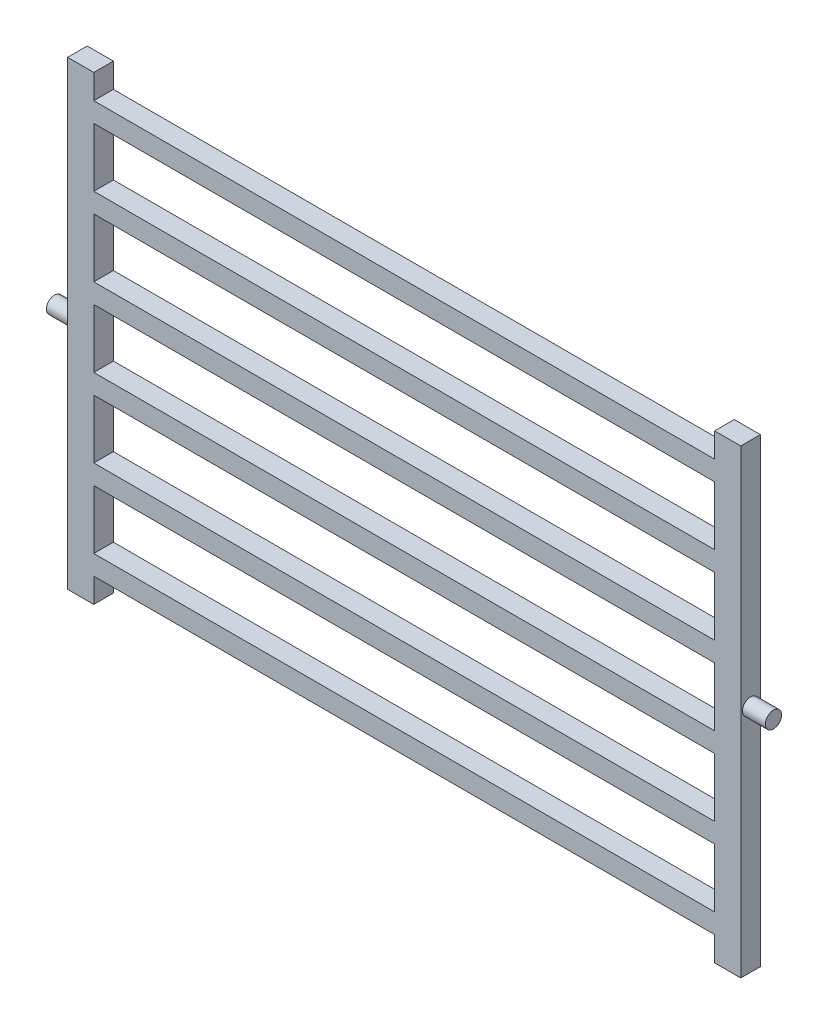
from build123d import *

# Parameters (mm, degrees)
BOSS_EXTRUDE3_START   = 2
SKETCH2_W             = 8
SKETCH2_H             = 141
BOSS_EXTRUDE3_DEPTH   = 6
BOSS_EXTRUDE3_2_DEPTH = 6
BOSS_EXTRUDE4_START   = 2
SKETCH3_W             = 190
SKETCH3_H             = 6
BOSS_EXTRUDE4_DEPTH   = 6
SKETCH8_R             = 2.5
BOSS_EXTRUDE7_DEPTH   = 7
BOSS_EXTRUDE8_START   = 7
SKETCH9_R             = 2.5
BOSS_EXTRUDE8_DEPTH   = 7


with BuildPart() as part:
    # Sketch2 → Boss-Extrude3 (new body)
    with BuildSketch(Plane.XY.offset(BOSS_EXTRUDE3_START)):
        with Locations((11, 87.5)):
            Rectangle(SKETCH2_W, SKETCH2_H)
    extrude(amount=BOSS_EXTRUDE3_DEPTH)



with BuildPart() as body_2:
    # Sketch2 → Boss-Extrude3 2 (new body)
    with BuildSketch(Plane.XY.offset(BOSS_EXTRUDE3_START)):
        with Locations((209, 87.5)):
            Rectangle(SKETCH2_W, SKETCH2_H)
    extrude(amount=BOSS_EXTRUDE3_2_DEPTH)


with BuildPart() as part_1:
    add(part.part)

    add(body_2.part)  # Boss-Extrude4 merges body 2
    # Sketch3 → Boss-Extrude4 (add)
    with BuildSketch(Plane.XY.offset(BOSS_EXTRUDE4_START)):
        with Locations((110, 51.5)):
            Rectangle(SKETCH3_W, SKETCH3_H)
        with Locations((110, 27.5)):
            Rectangle(SKETCH3_W, SKETCH3_H)
        with Locations((110, 75.5)):
            Rectangle(SKETCH3_W, SKETCH3_H)
        with Locations((110, 99.5)):
            Rectangle(SKETCH3_W, SKETCH3_H)
        with Locations((110, 123.5)):
            Rectangle(SKETCH3_W, SKETCH3_H)
        with Locations((110, 147.5)):
            Rectangle(SKETCH3_W, SKETCH3_H)
    extrude(amount=BOSS_EXTRUDE4_DEPTH)

    # Sketch8 → Boss-Extrude7 (add)
    with BuildSketch(Plane.ZY.offset(-7)):
        with Locations((5, 87.5)):
            Circle(SKETCH8_R)
    extrude(amount=BOSS_EXTRUDE7_DEPTH)

    # Sketch9 → Boss-Extrude8 (add)
    with BuildSketch(Plane(origin=(213, 0, 0), x_dir=(0, 0, -1), z_dir=(1, 0, 0)).offset(BOSS_EXTRUDE8_START)):
        with Locations(Location((-5, 87.5, 0), (0, 0, 180))):
            Circle(SKETCH9_R)
    extrude(amount=-BOSS_EXTRUDE8_DEPTH)


solid = part_1.part
